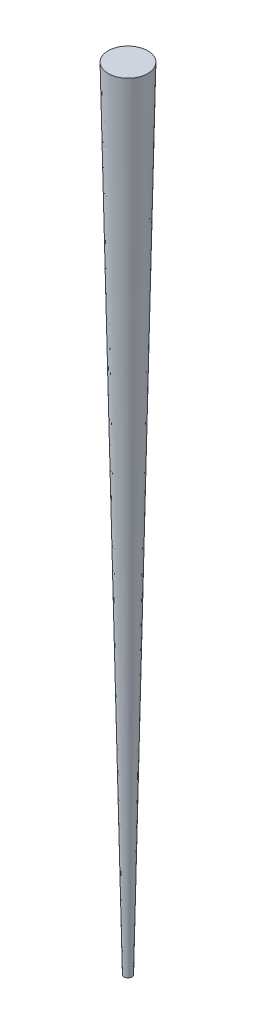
ISO-10303-21;
HEADER;
FILE_DESCRIPTION(('STEP AP214'),'2;1');
FILE_NAME('part.step','',(''),(''),'','','');
FILE_SCHEMA(('AUTOMOTIVE_DESIGN { 1 0 10303 214 1 1 1 1 }'));
ENDSEC;
DATA;
#1=APPLICATION_CONTEXT('core data for automotive mechanical design processes');
#2=APPLICATION_PROTOCOL_DEFINITION('international standard','automotive_design',2000,#1);
#3=PRODUCT_CONTEXT('',#1,'mechanical');
#4=PRODUCT('Part','Part','',(#3));
#5=PRODUCT_RELATED_PRODUCT_CATEGORY('part','',(#4));
#6=PRODUCT_DEFINITION_FORMATION('','',#4);
#7=PRODUCT_DEFINITION_CONTEXT('part definition',#1,'design');
#8=PRODUCT_DEFINITION('design','',#6,#7);
#9=PRODUCT_DEFINITION_SHAPE('','',#8);
#10=(LENGTH_UNIT() NAMED_UNIT(*) SI_UNIT(.MILLI.,.METRE.));
#11=(NAMED_UNIT(*) PLANE_ANGLE_UNIT() SI_UNIT($,.RADIAN.));
#12=(NAMED_UNIT(*) SI_UNIT($,.STERADIAN.) SOLID_ANGLE_UNIT());
#13=UNCERTAINTY_MEASURE_WITH_UNIT(LENGTH_MEASURE(1.E-05),#10,'distance_accuracy_value','');
#14=(GEOMETRIC_REPRESENTATION_CONTEXT(3) GLOBAL_UNCERTAINTY_ASSIGNED_CONTEXT((#13)) GLOBAL_UNIT_ASSIGNED_CONTEXT((#10,
#11,#12)) REPRESENTATION_CONTEXT('',''));
#15=CARTESIAN_POINT('',(0.,0.,0.));
#16=DIRECTION('',(0.,0.,1.));
#17=DIRECTION('',(1.,0.,0.));
#18=AXIS2_PLACEMENT_3D('',#15,#16,#17);
#19=CARTESIAN_POINT('',(0.5,0.,0.));
#20=DIRECTION('',(0.,-1.,0.));
#21=DIRECTION('',(0.,0.,-1.));
#22=AXIS2_PLACEMENT_3D('',#19,#20,#21);
#23=PLANE('',#22);
#24=CARTESIAN_POINT('',(0.,0.,0.));
#25=DIRECTION('',(0.,-1.,0.));
#26=DIRECTION('',(0.,0.,-1.));
#27=AXIS2_PLACEMENT_3D('',#24,#25,#26);
#28=CIRCLE('',#27,0.5);
#29=CARTESIAN_POINT('',(0.,0.,0.5));
#30=VERTEX_POINT('',#29);
#31=EDGE_CURVE('E37',#30,#30,#28,.T.);
#32=ORIENTED_EDGE('',*,*,#31,.T.);
#33=EDGE_LOOP('',(#32));
#34=FACE_BOUND('',#33,.T.);
#35=ADVANCED_FACE('F31',(#34),#23,.T.);
#36=CARTESIAN_POINT('',(0.,100.,0.));
#37=DIRECTION('',(0.,1.,0.));
#38=DIRECTION('',(0.,0.,1.));
#39=AXIS2_PLACEMENT_3D('',#36,#37,#38);
#40=PLANE('',#39);
#41=CARTESIAN_POINT('',(0.,100.,0.));
#42=DIRECTION('',(0.,-1.,0.));
#43=DIRECTION('',(0.,0.,-1.));
#44=AXIS2_PLACEMENT_3D('',#41,#42,#43);
#45=CIRCLE('',#44,2.5);
#46=CARTESIAN_POINT('',(0.,100.,2.5));
#47=VERTEX_POINT('',#46);
#48=EDGE_CURVE('E10',#47,#47,#45,.T.);
#49=ORIENTED_EDGE('',*,*,#48,.F.);
#50=EDGE_LOOP('',(#49));
#51=FACE_BOUND('',#50,.T.);
#52=ADVANCED_FACE('F46',(#51),#40,.T.);
#53=CARTESIAN_POINT('',(0.,0.,0.));
#54=DIRECTION('',(0.,1.,0.));
#55=DIRECTION('',(0.,0.,1.));
#56=AXIS2_PLACEMENT_3D('',#53,#54,#55);
#57=CONICAL_SURFACE('',#56,0.5,0.0199973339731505);
#58=CARTESIAN_POINT('',(0.,100.,2.5));
#59=CARTESIAN_POINT('',(0.,98.9583333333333,2.47916666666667));
#60=CARTESIAN_POINT('',(0.,97.9166666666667,2.45833333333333));
#61=CARTESIAN_POINT('',(0.,95.8333333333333,2.41666666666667));
#62=CARTESIAN_POINT('',(0.,94.7916666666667,2.39583333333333));
#63=CARTESIAN_POINT('',(0.,92.7083333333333,2.35416666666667));
#64=CARTESIAN_POINT('',(0.,91.6666666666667,2.33333333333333));
#65=CARTESIAN_POINT('',(0.,89.5833333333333,2.29166666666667));
#66=CARTESIAN_POINT('',(0.,88.5416666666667,2.27083333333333));
#67=CARTESIAN_POINT('',(0.,86.4583333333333,2.22916666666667));
#68=CARTESIAN_POINT('',(0.,85.4166666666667,2.20833333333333));
#69=CARTESIAN_POINT('',(0.,83.3333333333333,2.16666666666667));
#70=CARTESIAN_POINT('',(0.,82.2916666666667,2.14583333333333));
#71=CARTESIAN_POINT('',(0.,80.2083333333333,2.10416666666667));
#72=CARTESIAN_POINT('',(0.,79.1666666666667,2.08333333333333));
#73=CARTESIAN_POINT('',(0.,77.0833333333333,2.04166666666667));
#74=CARTESIAN_POINT('',(0.,76.0416666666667,2.02083333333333));
#75=CARTESIAN_POINT('',(0.,73.9583333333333,1.97916666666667));
#76=CARTESIAN_POINT('',(0.,72.9166666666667,1.95833333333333));
#77=CARTESIAN_POINT('',(0.,70.8333333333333,1.91666666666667));
#78=CARTESIAN_POINT('',(0.,69.7916666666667,1.89583333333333));
#79=CARTESIAN_POINT('',(0.,67.7083333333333,1.85416666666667));
#80=CARTESIAN_POINT('',(0.,66.6666666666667,1.83333333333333));
#81=CARTESIAN_POINT('',(0.,64.5833333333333,1.79166666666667));
#82=CARTESIAN_POINT('',(0.,63.5416666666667,1.77083333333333));
#83=CARTESIAN_POINT('',(0.,61.4583333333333,1.72916666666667));
#84=CARTESIAN_POINT('',(0.,60.4166666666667,1.70833333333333));
#85=CARTESIAN_POINT('',(0.,58.3333333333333,1.66666666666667));
#86=CARTESIAN_POINT('',(0.,57.2916666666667,1.64583333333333));
#87=CARTESIAN_POINT('',(0.,55.2083333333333,1.60416666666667));
#88=CARTESIAN_POINT('',(0.,54.1666666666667,1.58333333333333));
#89=CARTESIAN_POINT('',(0.,52.0833333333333,1.54166666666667));
#90=CARTESIAN_POINT('',(0.,51.0416666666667,1.52083333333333));
#91=CARTESIAN_POINT('',(0.,48.9583333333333,1.47916666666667));
#92=CARTESIAN_POINT('',(0.,47.9166666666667,1.45833333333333));
#93=CARTESIAN_POINT('',(0.,45.8333333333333,1.41666666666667));
#94=CARTESIAN_POINT('',(0.,44.7916666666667,1.39583333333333));
#95=CARTESIAN_POINT('',(0.,42.7083333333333,1.35416666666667));
#96=CARTESIAN_POINT('',(0.,41.6666666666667,1.33333333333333));
#97=CARTESIAN_POINT('',(0.,39.5833333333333,1.29166666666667));
#98=CARTESIAN_POINT('',(0.,38.5416666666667,1.27083333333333));
#99=CARTESIAN_POINT('',(0.,36.4583333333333,1.22916666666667));
#100=CARTESIAN_POINT('',(0.,35.4166666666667,1.20833333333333));
#101=CARTESIAN_POINT('',(0.,33.3333333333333,1.16666666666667));
#102=CARTESIAN_POINT('',(0.,32.2916666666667,1.14583333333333));
#103=CARTESIAN_POINT('',(0.,30.2083333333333,1.10416666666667));
#104=CARTESIAN_POINT('',(0.,29.1666666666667,1.08333333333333));
#105=CARTESIAN_POINT('',(0.,27.0833333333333,1.04166666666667));
#106=CARTESIAN_POINT('',(0.,26.0416666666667,1.02083333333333));
#107=CARTESIAN_POINT('',(0.,23.9583333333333,0.979166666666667));
#108=CARTESIAN_POINT('',(0.,22.9166666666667,0.958333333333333));
#109=CARTESIAN_POINT('',(0.,20.8333333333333,0.916666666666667));
#110=CARTESIAN_POINT('',(0.,19.7916666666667,0.895833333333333));
#111=CARTESIAN_POINT('',(0.,17.7083333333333,0.854166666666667));
#112=CARTESIAN_POINT('',(0.,16.6666666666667,0.833333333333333));
#113=CARTESIAN_POINT('',(0.,14.5833333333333,0.791666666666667));
#114=CARTESIAN_POINT('',(0.,13.5416666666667,0.770833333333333));
#115=CARTESIAN_POINT('',(0.,11.4583333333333,0.729166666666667));
#116=CARTESIAN_POINT('',(0.,10.4166666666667,0.708333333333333));
#117=CARTESIAN_POINT('',(0.,8.33333333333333,0.666666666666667));
#118=CARTESIAN_POINT('',(0.,7.29166666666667,0.645833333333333));
#119=CARTESIAN_POINT('',(0.,5.20833333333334,0.604166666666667));
#120=CARTESIAN_POINT('',(0.,4.16666666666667,0.583333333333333));
#121=CARTESIAN_POINT('',(0.,2.08333333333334,0.541666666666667));
#122=CARTESIAN_POINT('',(0.,1.04166666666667,0.520833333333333));
#123=CARTESIAN_POINT('',(0.,0.,0.5));
#124=B_SPLINE_CURVE_WITH_KNOTS('',3,(#58,#59,#60,#61,#62,#63,#64,#65,#66,#67,#68,#69,#70,#71,
#72,#73,#74,#75,#76,#77,#78,#79,#80,#81,#82,#83,#84,#85,#86,#87,#88,#89,#90,#91,#92,#93,#94,#95,
#96,#97,#98,#99,#100,#101,#102,#103,#104,#105,#106,#107,#108,#109,#110,#111,#112,#113,#114,#115,
#116,#117,#118,#119,#120,#121,#122,#123),.UNSPECIFIED.,.F.,.F.,(4,2,2,2,2,2,2,2,2,2,2,2,2,2,2,2,
2,2,2,2,2,2,2,2,2,2,2,2,2,2,2,2,4),(0.,3.1256249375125,6.251249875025,9.37687481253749,
12.50249975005,15.6281246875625,18.753749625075,21.8793745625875,25.0049995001,28.1306244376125,
31.256249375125,34.3818743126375,37.50749925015,40.6331241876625,43.758749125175,
46.8843740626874,50.0099990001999,53.1356239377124,56.2612488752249,59.3868738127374,
62.5124987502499,65.6381236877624,68.7637486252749,71.8893735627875,75.0149985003,
78.1406234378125,81.2662483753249,84.3918733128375,87.51749825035,90.6431231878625,
93.768748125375,96.8943730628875,100.0199980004),.UNSPECIFIED.);
#125=EDGE_CURVE('BSEAM44',#47,#30,#124,.T.);
#126=ORIENTED_EDGE('',*,*,#48,.T.);
#127=ORIENTED_EDGE('',*,*,#31,.F.);
#128=ORIENTED_EDGE('',*,*,#125,.T.);
#129=ORIENTED_EDGE('',*,*,#125,.F.);
#130=EDGE_LOOP('',(#126,#128,#127,#129));
#131=FACE_BOUND('',#130,.T.);
#132=ADVANCED_FACE('F44',(#131),#57,.T.);
#133=CLOSED_SHELL('',(#35,#52,#132));
#134=MANIFOLD_SOLID_BREP('B2',#133);
#135=ADVANCED_BREP_SHAPE_REPRESENTATION('',(#18,#134),#14);
#136=SHAPE_DEFINITION_REPRESENTATION(#9,#135);
ENDSEC;
END-ISO-10303-21;
